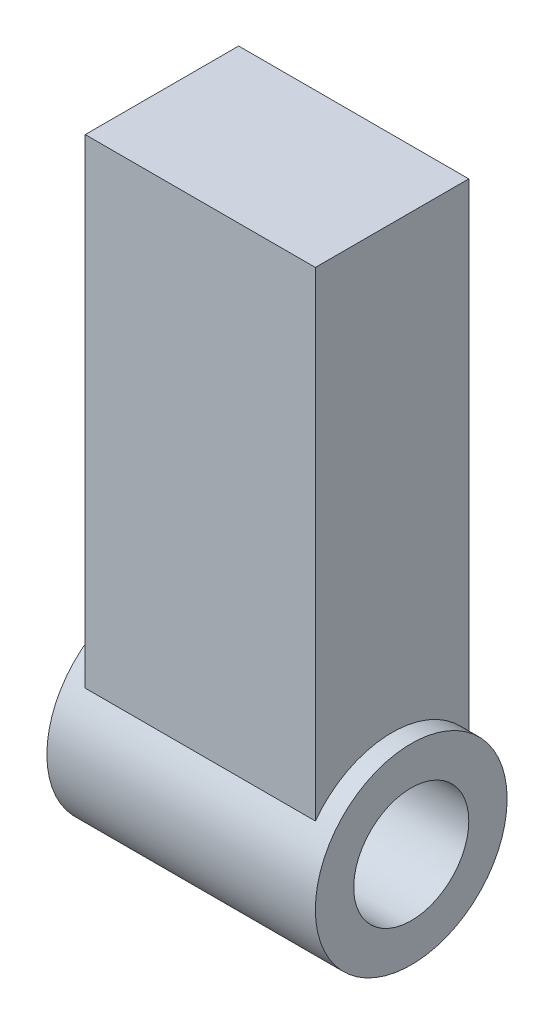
ISO-10303-21;
HEADER;
FILE_DESCRIPTION(('STEP AP214'),'2;1');
FILE_NAME('part.step','',(''),(''),'','','');
FILE_SCHEMA(('AUTOMOTIVE_DESIGN { 1 0 10303 214 1 1 1 1 }'));
ENDSEC;
DATA;
#1=APPLICATION_CONTEXT('core data for automotive mechanical design processes');
#2=APPLICATION_PROTOCOL_DEFINITION('international standard','automotive_design',2000,#1);
#3=PRODUCT_CONTEXT('',#1,'mechanical');
#4=PRODUCT('Part','Part','',(#3));
#5=PRODUCT_RELATED_PRODUCT_CATEGORY('part','',(#4));
#6=PRODUCT_DEFINITION_FORMATION('','',#4);
#7=PRODUCT_DEFINITION_CONTEXT('part definition',#1,'design');
#8=PRODUCT_DEFINITION('design','',#6,#7);
#9=PRODUCT_DEFINITION_SHAPE('','',#8);
#10=(LENGTH_UNIT() NAMED_UNIT(*) SI_UNIT(.MILLI.,.METRE.));
#11=(NAMED_UNIT(*) PLANE_ANGLE_UNIT() SI_UNIT($,.RADIAN.));
#12=(NAMED_UNIT(*) SI_UNIT($,.STERADIAN.) SOLID_ANGLE_UNIT());
#13=UNCERTAINTY_MEASURE_WITH_UNIT(LENGTH_MEASURE(1.E-05),#10,'distance_accuracy_value','');
#14=(GEOMETRIC_REPRESENTATION_CONTEXT(3) GLOBAL_UNCERTAINTY_ASSIGNED_CONTEXT((#13)) GLOBAL_UNIT_ASSIGNED_CONTEXT((#10,
#11,#12)) REPRESENTATION_CONTEXT('',''));
#15=CARTESIAN_POINT('',(0.,0.,0.));
#16=DIRECTION('',(0.,0.,1.));
#17=DIRECTION('',(1.,0.,0.));
#18=AXIS2_PLACEMENT_3D('',#15,#16,#17);
#19=CARTESIAN_POINT('',(0.,100.,0.));
#20=DIRECTION('',(1.,0.,0.));
#21=DIRECTION('',(0.,0.,-1.));
#22=AXIS2_PLACEMENT_3D('',#19,#20,#21);
#23=PLANE('',#22);
#24=DIRECTION('',(0.,-1.,0.));
#25=VECTOR('',#24,1.);
#26=CARTESIAN_POINT('',(0.,100.,-40.));
#27=LINE('',#26,#25);
#28=CARTESIAN_POINT('',(0.,100.,-40.));
#29=VERTEX_POINT('',#28);
#30=CARTESIAN_POINT('',(0.,-25.,-40.));
#31=VERTEX_POINT('',#30);
#32=EDGE_CURVE('E88',#29,#31,#27,.T.);
#33=ORIENTED_EDGE('',*,*,#32,.T.);
#34=CARTESIAN_POINT('',(0.,-40.,-20.));
#35=DIRECTION('',(1.,0.,0.));
#36=DIRECTION('',(0.,0.,-1.));
#37=AXIS2_PLACEMENT_3D('',#34,#35,#36);
#38=CIRCLE('',#37,25.);
#39=CARTESIAN_POINT('',(0.,-25.,0.));
#40=VERTEX_POINT('',#39);
#41=EDGE_CURVE('E92',#40,#31,#38,.F.);
#42=ORIENTED_EDGE('',*,*,#41,.F.);
#43=DIRECTION('',(0.,-1.,0.));
#44=VECTOR('',#43,1.);
#45=CARTESIAN_POINT('',(0.,100.,0.));
#46=LINE('',#45,#44);
#47=CARTESIAN_POINT('',(0.,100.,0.));
#48=VERTEX_POINT('',#47);
#49=EDGE_CURVE('E11',#48,#40,#46,.T.);
#50=ORIENTED_EDGE('',*,*,#49,.F.);
#51=DIRECTION('',(0.,0.,1.));
#52=VECTOR('',#51,1.);
#53=CARTESIAN_POINT('',(0.,100.,0.));
#54=LINE('',#53,#52);
#55=EDGE_CURVE('E80',#29,#48,#54,.T.);
#56=ORIENTED_EDGE('',*,*,#55,.F.);
#57=EDGE_LOOP('',(#33,#42,#50,#56));
#58=FACE_BOUND('',#57,.T.);
#59=ADVANCED_FACE('F33',(#58),#23,.F.);
#60=CARTESIAN_POINT('',(0.,100.,0.));
#61=DIRECTION('',(0.,0.,-1.));
#62=DIRECTION('',(-1.,0.,0.));
#63=AXIS2_PLACEMENT_3D('',#60,#61,#62);
#64=PLANE('',#63);
#65=ORIENTED_EDGE('',*,*,#49,.T.);
#66=DIRECTION('',(-1.,0.,0.));
#67=VECTOR('',#66,1.);
#68=CARTESIAN_POINT('',(65.,-25.,0.));
#69=LINE('',#68,#67);
#70=CARTESIAN_POINT('',(60.,-25.,0.));
#71=VERTEX_POINT('',#70);
#72=EDGE_CURVE('E81',#71,#40,#69,.T.);
#73=ORIENTED_EDGE('',*,*,#72,.F.);
#74=DIRECTION('',(0.,-1.,0.));
#75=VECTOR('',#74,1.);
#76=CARTESIAN_POINT('',(60.,100.,0.));
#77=LINE('',#76,#75);
#78=CARTESIAN_POINT('',(60.,100.,0.));
#79=VERTEX_POINT('',#78);
#80=EDGE_CURVE('E40',#79,#71,#77,.T.);
#81=ORIENTED_EDGE('',*,*,#80,.F.);
#82=DIRECTION('',(1.,0.,0.));
#83=VECTOR('',#82,1.);
#84=CARTESIAN_POINT('',(0.,100.,0.));
#85=LINE('',#84,#83);
#86=EDGE_CURVE('E103',#48,#79,#85,.T.);
#87=ORIENTED_EDGE('',*,*,#86,.F.);
#88=EDGE_LOOP('',(#65,#73,#81,#87));
#89=FACE_BOUND('',#88,.T.);
#90=ADVANCED_FACE('F112',(#89),#64,.F.);
#91=CARTESIAN_POINT('',(60.,100.,0.));
#92=DIRECTION('',(-1.,0.,0.));
#93=DIRECTION('',(0.,0.,1.));
#94=AXIS2_PLACEMENT_3D('',#91,#92,#93);
#95=PLANE('',#94);
#96=ORIENTED_EDGE('',*,*,#80,.T.);
#97=CARTESIAN_POINT('',(60.,-40.,-20.));
#98=DIRECTION('',(-1.,0.,0.));
#99=DIRECTION('',(0.,0.,1.));
#100=AXIS2_PLACEMENT_3D('',#97,#98,#99);
#101=CIRCLE('',#100,25.);
#102=CARTESIAN_POINT('',(60.,-25.,-40.));
#103=VERTEX_POINT('',#102);
#104=EDGE_CURVE('E71',#103,#71,#101,.F.);
#105=ORIENTED_EDGE('',*,*,#104,.F.);
#106=DIRECTION('',(0.,-1.,0.));
#107=VECTOR('',#106,1.);
#108=CARTESIAN_POINT('',(60.,100.,-40.));
#109=LINE('',#108,#107);
#110=CARTESIAN_POINT('',(60.,100.,-40.));
#111=VERTEX_POINT('',#110);
#112=EDGE_CURVE('E74',#111,#103,#109,.T.);
#113=ORIENTED_EDGE('',*,*,#112,.F.);
#114=DIRECTION('',(0.,0.,-1.));
#115=VECTOR('',#114,1.);
#116=CARTESIAN_POINT('',(60.,100.,0.));
#117=LINE('',#116,#115);
#118=EDGE_CURVE('E52',#79,#111,#117,.T.);
#119=ORIENTED_EDGE('',*,*,#118,.F.);
#120=EDGE_LOOP('',(#96,#105,#113,#119));
#121=FACE_BOUND('',#120,.T.);
#122=ADVANCED_FACE('F73',(#121),#95,.F.);
#123=CARTESIAN_POINT('',(0.,100.,-40.));
#124=DIRECTION('',(0.,0.,1.));
#125=DIRECTION('',(1.,0.,0.));
#126=AXIS2_PLACEMENT_3D('',#123,#124,#125);
#127=PLANE('',#126);
#128=ORIENTED_EDGE('',*,*,#112,.T.);
#129=DIRECTION('',(-1.,0.,0.));
#130=VECTOR('',#129,1.);
#131=CARTESIAN_POINT('',(65.,-25.,-40.));
#132=LINE('',#131,#130);
#133=EDGE_CURVE('E86',#31,#103,#132,.F.);
#134=ORIENTED_EDGE('',*,*,#133,.F.);
#135=ORIENTED_EDGE('',*,*,#32,.F.);
#136=DIRECTION('',(-1.,0.,0.));
#137=VECTOR('',#136,1.);
#138=CARTESIAN_POINT('',(0.,100.,-40.));
#139=LINE('',#138,#137);
#140=EDGE_CURVE('E47',#111,#29,#139,.T.);
#141=ORIENTED_EDGE('',*,*,#140,.F.);
#142=EDGE_LOOP('',(#128,#134,#135,#141));
#143=FACE_BOUND('',#142,.T.);
#144=ADVANCED_FACE('F85',(#143),#127,.F.);
#145=CARTESIAN_POINT('',(0.,100.,-40.));
#146=DIRECTION('',(0.,-1.,0.));
#147=DIRECTION('',(0.,0.,-1.));
#148=AXIS2_PLACEMENT_3D('',#145,#146,#147);
#149=PLANE('',#148);
#150=ORIENTED_EDGE('',*,*,#55,.T.);
#151=ORIENTED_EDGE('',*,*,#86,.T.);
#152=ORIENTED_EDGE('',*,*,#118,.T.);
#153=ORIENTED_EDGE('',*,*,#140,.T.);
#154=EDGE_LOOP('',(#150,#151,#152,#153));
#155=FACE_BOUND('',#154,.T.);
#156=ADVANCED_FACE('F110',(#155),#149,.F.);
#157=CARTESIAN_POINT('',(65.,-40.,-20.));
#158=DIRECTION('',(-1.,0.,0.));
#159=DIRECTION('',(0.,0.,1.));
#160=AXIS2_PLACEMENT_3D('',#157,#158,#159);
#161=CYLINDRICAL_SURFACE('',#160,25.);
#162=CARTESIAN_POINT('',(-5.,-40.,-20.));
#163=DIRECTION('',(1.,0.,0.));
#164=DIRECTION('',(0.,0.,-1.));
#165=AXIS2_PLACEMENT_3D('',#162,#163,#164);
#166=CIRCLE('',#165,25.);
#167=CARTESIAN_POINT('',(-5.,-40.,-45.));
#168=VERTEX_POINT('',#167);
#169=EDGE_CURVE('E146',#168,#168,#166,.T.);
#170=ORIENTED_EDGE('',*,*,#169,.T.);
#171=EDGE_LOOP('',(#170));
#172=FACE_BOUND('',#171,.T.);
#173=CARTESIAN_POINT('',(65.,-40.,-20.));
#174=DIRECTION('',(1.,0.,0.));
#175=DIRECTION('',(0.,0.,-1.));
#176=AXIS2_PLACEMENT_3D('',#173,#174,#175);
#177=CIRCLE('',#176,25.);
#178=CARTESIAN_POINT('',(65.,-40.,-45.));
#179=VERTEX_POINT('',#178);
#180=EDGE_CURVE('E93',#179,#179,#177,.T.);
#181=ORIENTED_EDGE('',*,*,#180,.F.);
#182=EDGE_LOOP('',(#181));
#183=FACE_BOUND('',#182,.T.);
#184=ORIENTED_EDGE('',*,*,#72,.T.);
#185=ORIENTED_EDGE('',*,*,#41,.T.);
#186=ORIENTED_EDGE('',*,*,#133,.T.);
#187=ORIENTED_EDGE('',*,*,#104,.T.);
#188=EDGE_LOOP('',(#184,#185,#186,#187));
#189=FACE_BOUND('',#188,.T.);
#190=ADVANCED_FACE('F90',(#172,#183,#189),#161,.T.);
#191=CARTESIAN_POINT('',(65.,-40.,-20.));
#192=DIRECTION('',(1.,0.,0.));
#193=DIRECTION('',(0.,0.,-1.));
#194=AXIS2_PLACEMENT_3D('',#191,#192,#193);
#195=PLANE('',#194);
#196=ORIENTED_EDGE('',*,*,#180,.T.);
#197=EDGE_LOOP('',(#196));
#198=FACE_BOUND('',#197,.T.);
#199=CARTESIAN_POINT('',(65.,-40.,-20.));
#200=DIRECTION('',(1.,0.,0.));
#201=DIRECTION('',(0.,0.,-1.));
#202=AXIS2_PLACEMENT_3D('',#199,#200,#201);
#203=CIRCLE('',#202,15.);
#204=CARTESIAN_POINT('',(65.,-40.,-35.));
#205=VERTEX_POINT('',#204);
#206=EDGE_CURVE('E97',#205,#205,#203,.T.);
#207=ORIENTED_EDGE('',*,*,#206,.F.);
#208=EDGE_LOOP('',(#207));
#209=FACE_BOUND('',#208,.T.);
#210=ADVANCED_FACE('F126',(#198,#209),#195,.T.);
#211=CARTESIAN_POINT('',(65.,-40.,-20.));
#212=DIRECTION('',(-1.,0.,0.));
#213=DIRECTION('',(0.,0.,1.));
#214=AXIS2_PLACEMENT_3D('',#211,#212,#213);
#215=CYLINDRICAL_SURFACE('',#214,15.);
#216=ORIENTED_EDGE('',*,*,#206,.T.);
#217=EDGE_LOOP('',(#216));
#218=FACE_BOUND('',#217,.T.);
#219=CARTESIAN_POINT('',(-5.,-40.,-20.));
#220=DIRECTION('',(1.,0.,0.));
#221=DIRECTION('',(0.,0.,-1.));
#222=AXIS2_PLACEMENT_3D('',#219,#220,#221);
#223=CIRCLE('',#222,15.);
#224=CARTESIAN_POINT('',(-5.,-40.,-35.));
#225=VERTEX_POINT('',#224);
#226=EDGE_CURVE('E143',#225,#225,#223,.T.);
#227=ORIENTED_EDGE('',*,*,#226,.F.);
#228=EDGE_LOOP('',(#227));
#229=FACE_BOUND('',#228,.T.);
#230=ADVANCED_FACE('F130',(#218,#229),#215,.F.);
#231=CARTESIAN_POINT('',(-5.,-40.,-20.));
#232=DIRECTION('',(1.,0.,0.));
#233=DIRECTION('',(0.,0.,-1.));
#234=AXIS2_PLACEMENT_3D('',#231,#232,#233);
#235=PLANE('',#234);
#236=ORIENTED_EDGE('',*,*,#226,.T.);
#237=EDGE_LOOP('',(#236));
#238=FACE_BOUND('',#237,.T.);
#239=ORIENTED_EDGE('',*,*,#169,.F.);
#240=EDGE_LOOP('',(#239));
#241=FACE_BOUND('',#240,.T.);
#242=ADVANCED_FACE('F134',(#238,#241),#235,.F.);
#243=CLOSED_SHELL('',(#59,#90,#122,#144,#156,#190,#210,#230,#242));
#244=MANIFOLD_SOLID_BREP('B2',#243);
#245=ADVANCED_BREP_SHAPE_REPRESENTATION('',(#18,#244),#14);
#246=SHAPE_DEFINITION_REPRESENTATION(#9,#245);
ENDSEC;
END-ISO-10303-21;
